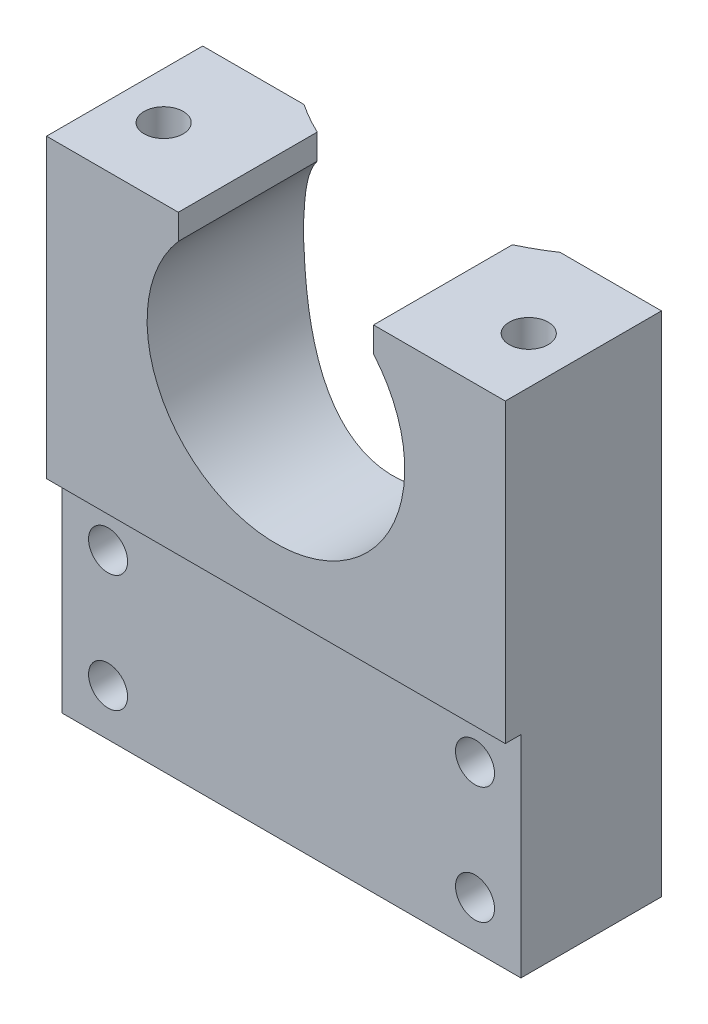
ISO-10303-21;
HEADER;
FILE_DESCRIPTION(('STEP AP214'),'2;1');
FILE_NAME('part.step','',(''),(''),'','','');
FILE_SCHEMA(('AUTOMOTIVE_DESIGN { 1 0 10303 214 1 1 1 1 }'));
ENDSEC;
DATA;
#1=APPLICATION_CONTEXT('core data for automotive mechanical design processes');
#2=APPLICATION_PROTOCOL_DEFINITION('international standard','automotive_design',2000,#1);
#3=PRODUCT_CONTEXT('',#1,'mechanical');
#4=PRODUCT('Part','Part','',(#3));
#5=PRODUCT_RELATED_PRODUCT_CATEGORY('part','',(#4));
#6=PRODUCT_DEFINITION_FORMATION('','',#4);
#7=PRODUCT_DEFINITION_CONTEXT('part definition',#1,'design');
#8=PRODUCT_DEFINITION('design','',#6,#7);
#9=PRODUCT_DEFINITION_SHAPE('','',#8);
#10=(LENGTH_UNIT() NAMED_UNIT(*) SI_UNIT(.MILLI.,.METRE.));
#11=(NAMED_UNIT(*) PLANE_ANGLE_UNIT() SI_UNIT($,.RADIAN.));
#12=(NAMED_UNIT(*) SI_UNIT($,.STERADIAN.) SOLID_ANGLE_UNIT());
#13=UNCERTAINTY_MEASURE_WITH_UNIT(LENGTH_MEASURE(1.E-05),#10,'distance_accuracy_value','');
#14=(GEOMETRIC_REPRESENTATION_CONTEXT(3) GLOBAL_UNCERTAINTY_ASSIGNED_CONTEXT((#13)) GLOBAL_UNIT_ASSIGNED_CONTEXT((#10,
#11,#12)) REPRESENTATION_CONTEXT('',''));
#15=CARTESIAN_POINT('',(0.,0.,0.));
#16=DIRECTION('',(0.,0.,1.));
#17=DIRECTION('',(1.,0.,0.));
#18=AXIS2_PLACEMENT_3D('',#15,#16,#17);
#19=CARTESIAN_POINT('',(0.,82.55,-56.3626));
#20=DIRECTION('',(0.,-1.,0.));
#21=DIRECTION('',(0.,0.,-1.));
#22=AXIS2_PLACEMENT_3D('',#19,#20,#21);
#23=CYLINDRICAL_SURFACE('',#22,37.3126);
#24=DIRECTION('',(0.,-1.,0.));
#25=VECTOR('',#24,1.);
#26=CARTESIAN_POINT('',(-20.8218039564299,82.55,-25.4));
#27=LINE('',#26,#25);
#28=CARTESIAN_POINT('',(-20.8218039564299,0.,-25.4));
#29=VERTEX_POINT('',#28);
#30=CARTESIAN_POINT('',(-20.8218039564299,62.4110796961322,-25.4));
#31=VERTEX_POINT('',#30);
#32=EDGE_CURVE('E267',#29,#31,#27,.F.);
#33=ORIENTED_EDGE('',*,*,#32,.T.);
#34=CARTESIAN_POINT('',(-20.8218039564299,62.4110796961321,-25.4));
#35=CARTESIAN_POINT('',(-20.7899938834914,62.1302744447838,-25.3786147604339));
#36=CARTESIAN_POINT('',(-20.7525346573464,61.8504444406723,-25.3534881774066));
#37=CARTESIAN_POINT('',(-20.6664908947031,61.293273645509,-25.2960741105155));
#38=CARTESIAN_POINT('',(-20.6179077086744,61.015932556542,-25.2637874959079));
#39=CARTESIAN_POINT('',(-20.4558594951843,60.1890707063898,-25.1567544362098));
#40=CARTESIAN_POINT('',(-20.3260116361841,59.6439737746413,-25.0717771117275));
#41=CARTESIAN_POINT('',(-20.0255086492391,58.5733533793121,-24.8786246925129));
#42=CARTESIAN_POINT('',(-19.8551156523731,58.0477282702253,-24.7705990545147));
#43=CARTESIAN_POINT('',(-19.4750880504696,57.015283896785,-24.5349229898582));
#44=CARTESIAN_POINT('',(-19.265443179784,56.5084695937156,-24.407267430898));
#45=CARTESIAN_POINT('',(-18.8099283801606,55.5182729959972,-24.1370432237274));
#46=CARTESIAN_POINT('',(-18.5642110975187,55.0348028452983,-23.9945381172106));
#47=CARTESIAN_POINT('',(-18.0378137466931,54.0909894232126,-23.6982680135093));
#48=CARTESIAN_POINT('',(-17.757136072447,53.6306445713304,-23.5445037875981));
#49=CARTESIAN_POINT('',(-17.1618961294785,52.7337369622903,-23.2293378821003));
#50=CARTESIAN_POINT('',(-16.8472664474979,52.2972242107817,-23.0679213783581));
#51=CARTESIAN_POINT('',(-16.1861152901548,51.4504554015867,-22.7415393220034));
#52=CARTESIAN_POINT('',(-15.8395918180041,51.0402009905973,-22.5765735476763));
#53=CARTESIAN_POINT('',(-15.0752974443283,50.2027784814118,-22.2281428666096));
#54=CARTESIAN_POINT('',(-14.6538977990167,49.7789099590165,-22.0446871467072));
#55=CARTESIAN_POINT('',(-13.7752658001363,48.9677343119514,-21.6826641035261));
#56=CARTESIAN_POINT('',(-13.3180310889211,48.580429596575,-21.5040971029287));
#57=CARTESIAN_POINT('',(-12.3698535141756,47.844910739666,-21.1564680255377));
#58=CARTESIAN_POINT('',(-11.8789170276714,47.496689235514,-20.9874041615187));
#59=CARTESIAN_POINT('',(-10.8656122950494,46.8419686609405,-20.6631388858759));
#60=CARTESIAN_POINT('',(-10.3432449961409,46.535468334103,-20.5079370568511));
#61=CARTESIAN_POINT('',(-9.26707612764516,45.9655870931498,-20.2147922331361));
#62=CARTESIAN_POINT('',(-8.71312369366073,45.7024414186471,-20.0769442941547));
#63=CARTESIAN_POINT('',(-7.57986868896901,45.2242642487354,-19.8234050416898));
#64=CARTESIAN_POINT('',(-7.00056556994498,45.009233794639,-19.7077142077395));
#65=CARTESIAN_POINT('',(-5.821554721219,44.630373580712,-19.5020880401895));
#66=CARTESIAN_POINT('',(-5.22186577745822,44.4664980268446,-19.4121296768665));
#67=CARTESIAN_POINT('',(-4.00687514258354,44.1922294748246,-19.2607184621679));
#68=CARTESIAN_POINT('',(-3.39157589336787,44.0818281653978,-19.1992611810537));
#69=CARTESIAN_POINT('',(-2.22671323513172,43.9263928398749,-19.112492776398));
#70=CARTESIAN_POINT('',(-1.67824201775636,43.8750483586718,-19.0836981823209));
#71=CARTESIAN_POINT('',(-0.578242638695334,43.8157416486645,-19.0504249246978));
#72=CARTESIAN_POINT('',(-0.0267147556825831,43.8077755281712,-19.045944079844));
#73=CARTESIAN_POINT('',(1.074770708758,43.8353310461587,-19.0614158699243));
#74=CARTESIAN_POINT('',(1.62472862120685,43.8708427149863,-19.0813629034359));
#75=CARTESIAN_POINT('',(2.71876017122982,43.9848412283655,-19.1451486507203));
#76=CARTESIAN_POINT('',(3.26283388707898,44.0633275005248,-19.1889870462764));
#77=CARTESIAN_POINT('',(4.3066221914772,44.2558933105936,-19.2958938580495));
#78=CARTESIAN_POINT('',(4.80695954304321,44.3673958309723,-19.357564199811));
#79=CARTESIAN_POINT('',(5.7956302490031,44.6259250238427,-19.4994723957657));
#80=CARTESIAN_POINT('',(6.28396429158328,44.772949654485,-19.5797091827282));
#81=CARTESIAN_POINT('',(7.2458750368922,45.1010504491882,-19.7570453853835));
#82=CARTESIAN_POINT('',(7.71945176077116,45.2821265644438,-19.8541447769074));
#83=CARTESIAN_POINT('',(8.64948729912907,45.6767130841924,-20.0632375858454));
#84=CARTESIAN_POINT('',(9.10594515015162,45.8902253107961,-20.1752318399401));
#85=CARTESIAN_POINT('',(10.0288456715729,46.3629278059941,-20.4196613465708));
#86=CARTESIAN_POINT('',(10.4940010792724,46.6241878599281,-20.5529530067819));
#87=CARTESIAN_POINT('',(11.4005552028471,47.1796049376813,-20.8311727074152));
#88=CARTESIAN_POINT('',(11.8419531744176,47.4737629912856,-20.9761011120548));
#89=CARTESIAN_POINT('',(12.6997211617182,48.0933901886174,-21.2748007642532));
#90=CARTESIAN_POINT('',(13.1160660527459,48.4188899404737,-21.4285805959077));
#91=CARTESIAN_POINT('',(13.921801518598,49.0992141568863,-21.7417907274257));
#92=CARTESIAN_POINT('',(14.3111904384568,49.4540404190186,-21.9012213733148));
#93=CARTESIAN_POINT('',(15.1079860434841,50.2369333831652,-22.2423844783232));
#94=CARTESIAN_POINT('',(15.5116898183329,50.6686353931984,-22.4244419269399));
#95=CARTESIAN_POINT('',(16.2815241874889,51.5649616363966,-22.7869667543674));
#96=CARTESIAN_POINT('',(16.6476538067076,52.0295867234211,-22.9674340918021));
#97=CARTESIAN_POINT('',(17.3398676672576,52.9890657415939,-23.3215644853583));
#98=CARTESIAN_POINT('',(17.6660120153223,53.4838725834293,-23.4952374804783));
#99=CARTESIAN_POINT('',(18.2767548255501,54.5023432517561,-23.8308953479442));
#100=CARTESIAN_POINT('',(18.5613523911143,55.0260077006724,-23.9928799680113));
#101=CARTESIAN_POINT('',(19.0815393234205,56.0895267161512,-24.2968235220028));
#102=CARTESIAN_POINT('',(19.3179605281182,56.6288813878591,-24.4391057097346));
#103=CARTESIAN_POINT('',(19.7459289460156,57.7301884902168,-24.7020317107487));
#104=CARTESIAN_POINT('',(19.9374911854,58.2921332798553,-24.8226827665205));
#105=CARTESIAN_POINT('',(20.1897805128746,59.1508656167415,-24.9840584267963));
#106=CARTESIAN_POINT('',(20.2682306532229,59.4407076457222,-25.0347150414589));
#107=CARTESIAN_POINT('',(20.4128365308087,60.024627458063,-25.1287454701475));
#108=CARTESIAN_POINT('',(20.4789927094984,60.3187050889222,-25.1721195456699));
#109=CARTESIAN_POINT('',(20.5987931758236,60.9108432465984,-25.2511063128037));
#110=CARTESIAN_POINT('',(20.6524207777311,61.2089085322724,-25.2867086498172));
#111=CARTESIAN_POINT('',(20.746819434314,61.8079779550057,-25.3496567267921));
#112=CARTESIAN_POINT('',(20.7875885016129,62.1089825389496,-25.3770011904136));
#113=CARTESIAN_POINT('',(20.8218039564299,62.4110796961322,-25.4));
#114=B_SPLINE_CURVE_WITH_KNOTS('',3,(#34,#35,#36,#37,#38,#39,#40,#41,#42,#43,#44,#45,#46,#47,
#48,#49,#50,#51,#52,#53,#54,#55,#56,#57,#58,#59,#60,#61,#62,#63,#64,#65,#66,#67,#68,#69,#70,#71,
#72,#73,#74,#75,#76,#77,#78,#79,#80,#81,#82,#83,#84,#85,#86,#87,#88,#89,#90,#91,#92,#93,#94,#95,
#96,#97,#98,#99,#100,#101,#102,#103,#104,#105,#106,#107,#108,#109,#110,#111,#112,#113),
.UNSPECIFIED.,.F.,.F.,(4,2,2,2,2,2,2,2,2,2,2,2,2,2,2,2,2,2,2,2,2,2,2,2,2,2,2,2,2,2,2,2,2,2,2,2,
2,2,2,4),(0.,0.850051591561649,1.70000003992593,3.3976720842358,5.08465312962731,
6.77207599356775,8.45255376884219,10.1329165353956,11.8166793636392,13.5005476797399,
15.3740762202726,17.2477281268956,19.121026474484,20.9942683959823,22.8773616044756,
24.7604955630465,26.6419388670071,28.5230896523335,30.175772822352,31.8283077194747,
33.4804637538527,35.1325977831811,36.6798079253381,38.2269291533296,39.7740481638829,
41.3212541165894,42.9692707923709,44.6173390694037,46.2670334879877,47.9168291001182,
49.7701431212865,51.6235052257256,53.4740462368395,55.3246271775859,57.1398811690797,
58.9545262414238,59.8677676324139,60.7809762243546,61.6953941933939,62.6099534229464),.UNSPECIFIED.);
#115=CARTESIAN_POINT('',(20.8218039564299,62.4110796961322,-25.4));
#116=VERTEX_POINT('',#115);
#117=EDGE_CURVE('E57',#31,#116,#114,.T.);
#118=ORIENTED_EDGE('',*,*,#117,.T.);
#119=DIRECTION('',(0.,-1.,0.));
#120=VECTOR('',#119,1.);
#121=CARTESIAN_POINT('',(20.8218039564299,82.55,-25.4));
#122=LINE('',#121,#120);
#123=CARTESIAN_POINT('',(20.8218039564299,0.,-25.4));
#124=VERTEX_POINT('',#123);
#125=EDGE_CURVE('E266',#116,#124,#122,.T.);
#126=ORIENTED_EDGE('',*,*,#125,.T.);
#127=CARTESIAN_POINT('',(0.,0.,-56.3626));
#128=DIRECTION('',(0.,-1.,0.));
#129=DIRECTION('',(0.,0.,1.));
#130=AXIS2_PLACEMENT_3D('',#127,#128,#129);
#131=CIRCLE('',#130,37.3126);
#132=EDGE_CURVE('E280',#124,#29,#131,.T.);
#133=ORIENTED_EDGE('',*,*,#132,.T.);
#134=EDGE_LOOP('',(#33,#118,#126,#133));
#135=FACE_BOUND('',#134,.T.);
#136=ADVANCED_FACE('F34',(#135),#23,.F.);
#137=CARTESIAN_POINT('',(20.8218039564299,67.1289203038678,-25.4));
#138=CARTESIAN_POINT('',(20.7896968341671,67.412347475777,-25.3784152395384));
#139=CARTESIAN_POINT('',(20.7518347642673,67.6947799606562,-25.3530188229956));
#140=CARTESIAN_POINT('',(20.664778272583,68.2571046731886,-25.2949338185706));
#141=CARTESIAN_POINT('',(20.6155851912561,68.5369971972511,-25.2622460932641));
#142=CARTESIAN_POINT('',(20.4514017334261,69.3714299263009,-25.1538256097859));
#143=CARTESIAN_POINT('',(20.3197244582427,69.9214497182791,-25.0676788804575));
#144=CARTESIAN_POINT('',(20.0176544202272,70.9915071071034,-24.8736349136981));
#145=CARTESIAN_POINT('',(19.8483000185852,71.5119498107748,-24.7663284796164));
#146=CARTESIAN_POINT('',(19.4711137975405,72.5343177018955,-24.5325034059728));
#147=CARTESIAN_POINT('',(19.2632759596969,73.0362399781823,-24.4059817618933));
#148=CARTESIAN_POINT('',(18.8332224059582,73.97109190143,-24.150861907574));
#149=CARTESIAN_POINT('',(18.614390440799,74.405973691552,-24.0236719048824));
#150=CARTESIAN_POINT('',(18.1484056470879,75.2572696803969,-23.7598827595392));
#151=CARTESIAN_POINT('',(17.9012543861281,75.6736848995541,-23.623284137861));
#152=CARTESIAN_POINT('',(17.3738287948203,76.4963114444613,-23.3403083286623));
#153=CARTESIAN_POINT('',(17.0929192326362,76.902062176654,-23.193777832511));
#154=CARTESIAN_POINT('',(16.5039953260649,77.6917884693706,-22.8968380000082));
#155=CARTESIAN_POINT('',(16.1959855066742,78.0757676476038,-22.7464293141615));
#156=CARTESIAN_POINT('',(15.875,78.4483186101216,-22.5955377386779));
#157=B_SPLINE_CURVE_WITH_KNOTS('',3,(#137,#138,#139,#140,#141,#142,#143,#144,#145,#146,#147,
#148,#149,#150,#151,#152,#153,#154,#155,#156),.UNSPECIFIED.,.F.,.F.,(4,2,2,2,2,2,2,2,2,4),(0.,
0.85798401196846,1.71586657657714,3.42944667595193,5.10063490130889,6.77208470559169,
8.28038104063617,9.78859392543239,11.3317836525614,12.8747161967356),.UNSPECIFIED.);
#158=CARTESIAN_POINT('',(20.8218039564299,67.1289203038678,-25.4));
#159=VERTEX_POINT('',#158);
#160=CARTESIAN_POINT('',(15.875,78.4483186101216,-22.5955377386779));
#161=VERTEX_POINT('',#160);
#162=EDGE_CURVE('E229',#159,#161,#157,.T.);
#163=ORIENTED_EDGE('',*,*,#162,.T.);
#164=DIRECTION('',(0.,-1.,0.));
#165=VECTOR('',#164,1.);
#166=CARTESIAN_POINT('',(15.875,82.55,-22.5955377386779));
#167=LINE('',#166,#165);
#168=CARTESIAN_POINT('',(15.875,82.55,-22.5955377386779));
#169=VERTEX_POINT('',#168);
#170=EDGE_CURVE('E256',#161,#169,#167,.F.);
#171=ORIENTED_EDGE('',*,*,#170,.T.);
#172=CARTESIAN_POINT('',(0.,82.55,-56.3626));
#173=DIRECTION('',(0.,-1.,0.));
#174=DIRECTION('',(0.,0.,1.));
#175=AXIS2_PLACEMENT_3D('',#172,#173,#174);
#176=CIRCLE('',#175,37.3126);
#177=CARTESIAN_POINT('',(20.8218039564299,82.55,-25.4));
#178=VERTEX_POINT('',#177);
#179=EDGE_CURVE('E288',#178,#169,#176,.T.);
#180=ORIENTED_EDGE('',*,*,#179,.F.);
#181=EDGE_CURVE('E262',#178,#159,#122,.T.);
#182=ORIENTED_EDGE('',*,*,#181,.T.);
#183=EDGE_LOOP('',(#163,#171,#180,#182));
#184=FACE_BOUND('',#183,.T.);
#185=ADVANCED_FACE('F369',(#184),#23,.F.);
#186=CARTESIAN_POINT('',(0.,82.55,-56.3626));
#187=DIRECTION('',(0.,1.,0.));
#188=DIRECTION('',(0.,0.,1.));
#189=AXIS2_PLACEMENT_3D('',#186,#187,#188);
#190=PLANE('',#189);
#191=CARTESIAN_POINT('',(29.6926,82.55,-11.43));
#192=DIRECTION('',(0.,1.,0.));
#193=DIRECTION('',(0.,0.,1.));
#194=AXIS2_PLACEMENT_3D('',#191,#192,#193);
#195=CIRCLE('',#194,3.17499999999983);
#196=CARTESIAN_POINT('',(29.6926,82.55,-8.25500000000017));
#197=VERTEX_POINT('',#196);
#198=EDGE_CURVE('E149',#197,#197,#195,.T.);
#199=ORIENTED_EDGE('',*,*,#198,.F.);
#200=EDGE_LOOP('',(#199));
#201=FACE_BOUND('',#200,.T.);
#202=DIRECTION('',(0.,0.,-1.));
#203=VECTOR('',#202,1.);
#204=CARTESIAN_POINT('',(15.875,82.55,-56.3626));
#205=LINE('',#204,#203);
#206=CARTESIAN_POINT('',(15.875,82.55,0.));
#207=VERTEX_POINT('',#206);
#208=EDGE_CURVE('E11',#207,#169,#205,.T.);
#209=ORIENTED_EDGE('',*,*,#208,.F.);
#210=DIRECTION('',(1.,0.,0.));
#211=VECTOR('',#210,1.);
#212=CARTESIAN_POINT('',(37.3126,82.55,0.));
#213=LINE('',#212,#211);
#214=CARTESIAN_POINT('',(37.3126,82.55,0.));
#215=VERTEX_POINT('',#214);
#216=EDGE_CURVE('E279',#207,#215,#213,.T.);
#217=ORIENTED_EDGE('',*,*,#216,.T.);
#218=DIRECTION('',(0.,0.,-1.));
#219=VECTOR('',#218,1.);
#220=CARTESIAN_POINT('',(37.3126,82.55,0.));
#221=LINE('',#220,#219);
#222=CARTESIAN_POINT('',(37.3126,82.55,-25.4));
#223=VERTEX_POINT('',#222);
#224=EDGE_CURVE('E284',#215,#223,#221,.T.);
#225=ORIENTED_EDGE('',*,*,#224,.T.);
#226=DIRECTION('',(1.,0.,0.));
#227=VECTOR('',#226,1.);
#228=CARTESIAN_POINT('',(-44.45,82.55,-25.4));
#229=LINE('',#228,#227);
#230=EDGE_CURVE('E259',#178,#223,#229,.T.);
#231=ORIENTED_EDGE('',*,*,#230,.F.);
#232=ORIENTED_EDGE('',*,*,#179,.T.);
#233=EDGE_LOOP('',(#209,#217,#225,#231,#232));
#234=FACE_BOUND('',#233,.T.);
#235=ADVANCED_FACE('F339',(#201,#234),#190,.T.);
#236=CARTESIAN_POINT('',(-37.3126,82.55,0.));
#237=DIRECTION('',(1.,0.,0.));
#238=DIRECTION('',(0.,0.,-1.));
#239=AXIS2_PLACEMENT_3D('',#236,#237,#238);
#240=PLANE('',#239);
#241=DIRECTION('',(0.,-1.,0.));
#242=VECTOR('',#241,1.);
#243=CARTESIAN_POINT('',(-37.3126,0.,-2.54));
#244=LINE('',#243,#242);
#245=CARTESIAN_POINT('',(-37.3126,34.29,-2.54));
#246=VERTEX_POINT('',#245);
#247=CARTESIAN_POINT('',(-37.3126,0.,-2.54));
#248=VERTEX_POINT('',#247);
#249=EDGE_CURVE('E49',#246,#248,#244,.T.);
#250=ORIENTED_EDGE('',*,*,#249,.F.);
#251=DIRECTION('',(0.,0.,1.));
#252=VECTOR('',#251,1.);
#253=CARTESIAN_POINT('',(-37.3126,34.29,-2.54));
#254=LINE('',#253,#252);
#255=CARTESIAN_POINT('',(-37.3126,34.29,0.));
#256=VERTEX_POINT('',#255);
#257=EDGE_CURVE('E202',#246,#256,#254,.T.);
#258=ORIENTED_EDGE('',*,*,#257,.T.);
#259=DIRECTION('',(0.,-1.,0.));
#260=VECTOR('',#259,1.);
#261=CARTESIAN_POINT('',(-37.3126,82.55,0.));
#262=LINE('',#261,#260);
#263=CARTESIAN_POINT('',(-37.3126,82.55,0.));
#264=VERTEX_POINT('',#263);
#265=EDGE_CURVE('E300',#264,#256,#262,.T.);
#266=ORIENTED_EDGE('',*,*,#265,.F.);
#267=DIRECTION('',(0.,0.,1.));
#268=VECTOR('',#267,1.);
#269=CARTESIAN_POINT('',(-37.3126,82.55,0.));
#270=LINE('',#269,#268);
#271=CARTESIAN_POINT('',(-37.3126,82.55,-25.4));
#272=VERTEX_POINT('',#271);
#273=EDGE_CURVE('E277',#272,#264,#270,.T.);
#274=ORIENTED_EDGE('',*,*,#273,.F.);
#275=DIRECTION('',(0.,-1.,0.));
#276=VECTOR('',#275,1.);
#277=CARTESIAN_POINT('',(-37.3126,82.55,-25.4));
#278=LINE('',#277,#276);
#279=CARTESIAN_POINT('',(-37.3126,0.,-25.4));
#280=VERTEX_POINT('',#279);
#281=EDGE_CURVE('E273',#272,#280,#278,.T.);
#282=ORIENTED_EDGE('',*,*,#281,.T.);
#283=DIRECTION('',(0.,0.,1.));
#284=VECTOR('',#283,1.);
#285=CARTESIAN_POINT('',(-37.3126,0.,0.));
#286=LINE('',#285,#284);
#287=EDGE_CURVE('E276',#280,#248,#286,.T.);
#288=ORIENTED_EDGE('',*,*,#287,.T.);
#289=EDGE_LOOP('',(#250,#258,#266,#274,#282,#288));
#290=FACE_BOUND('',#289,.T.);
#291=ADVANCED_FACE('F36',(#290),#240,.F.);
#292=CARTESIAN_POINT('',(37.3126,82.55,0.));
#293=DIRECTION('',(0.,0.,-1.));
#294=DIRECTION('',(-1.,0.,0.));
#295=AXIS2_PLACEMENT_3D('',#292,#293,#294);
#296=PLANE('',#295);
#297=ORIENTED_EDGE('',*,*,#265,.T.);
#298=DIRECTION('',(-1.,0.,0.));
#299=VECTOR('',#298,1.);
#300=CARTESIAN_POINT('',(-37.3126,34.29,0.));
#301=LINE('',#300,#299);
#302=CARTESIAN_POINT('',(37.3126,34.29,0.));
#303=VERTEX_POINT('',#302);
#304=EDGE_CURVE('E192',#303,#256,#301,.T.);
#305=ORIENTED_EDGE('',*,*,#304,.F.);
#306=DIRECTION('',(0.,-1.,0.));
#307=VECTOR('',#306,1.);
#308=CARTESIAN_POINT('',(37.3126,82.55,0.));
#309=LINE('',#308,#307);
#310=EDGE_CURVE('E291',#215,#303,#309,.T.);
#311=ORIENTED_EDGE('',*,*,#310,.F.);
#312=ORIENTED_EDGE('',*,*,#216,.F.);
#313=DIRECTION('',(0.,1.,0.));
#314=VECTOR('',#313,1.);
#315=CARTESIAN_POINT('',(15.875,82.55,0.));
#316=LINE('',#315,#314);
#317=CARTESIAN_POINT('',(15.875,78.4483186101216,0.));
#318=VERTEX_POINT('',#317);
#319=EDGE_CURVE('E205',#318,#207,#316,.T.);
#320=ORIENTED_EDGE('',*,*,#319,.F.);
#321=CARTESIAN_POINT('',(0.,64.77,0.));
#322=DIRECTION('',(0.,0.,1.));
#323=DIRECTION('',(1.,0.,0.));
#324=AXIS2_PLACEMENT_3D('',#321,#322,#323);
#325=CIRCLE('',#324,20.955);
#326=CARTESIAN_POINT('',(-15.875,78.4483186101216,0.));
#327=VERTEX_POINT('',#326);
#328=EDGE_CURVE('E211',#327,#318,#325,.T.);
#329=ORIENTED_EDGE('',*,*,#328,.F.);
#330=DIRECTION('',(0.,-1.,0.));
#331=VECTOR('',#330,1.);
#332=CARTESIAN_POINT('',(-15.875,78.4483186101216,0.));
#333=LINE('',#332,#331);
#334=CARTESIAN_POINT('',(-15.875,82.55,0.));
#335=VERTEX_POINT('',#334);
#336=EDGE_CURVE('E213',#335,#327,#333,.T.);
#337=ORIENTED_EDGE('',*,*,#336,.F.);
#338=EDGE_CURVE('E281',#264,#335,#213,.T.);
#339=ORIENTED_EDGE('',*,*,#338,.F.);
#340=EDGE_LOOP('',(#297,#305,#311,#312,#320,#329,#337,#339));
#341=FACE_BOUND('',#340,.T.);
#342=ADVANCED_FACE('F317',(#341),#296,.F.);
#343=CARTESIAN_POINT('',(37.3126,82.55,0.));
#344=DIRECTION('',(-1.,0.,0.));
#345=DIRECTION('',(0.,0.,1.));
#346=AXIS2_PLACEMENT_3D('',#343,#344,#345);
#347=PLANE('',#346);
#348=ORIENTED_EDGE('',*,*,#310,.T.);
#349=DIRECTION('',(0.,0.,1.));
#350=VECTOR('',#349,1.);
#351=CARTESIAN_POINT('',(37.3126,34.29,-2.54));
#352=LINE('',#351,#350);
#353=CARTESIAN_POINT('',(37.3126,34.29,-2.54));
#354=VERTEX_POINT('',#353);
#355=EDGE_CURVE('E200',#354,#303,#352,.T.);
#356=ORIENTED_EDGE('',*,*,#355,.F.);
#357=DIRECTION('',(0.,1.,0.));
#358=VECTOR('',#357,1.);
#359=CARTESIAN_POINT('',(37.3126,0.,-2.54));
#360=LINE('',#359,#358);
#361=CARTESIAN_POINT('',(37.3126,0.,-2.54));
#362=VERTEX_POINT('',#361);
#363=EDGE_CURVE('E196',#362,#354,#360,.T.);
#364=ORIENTED_EDGE('',*,*,#363,.F.);
#365=DIRECTION('',(0.,0.,-1.));
#366=VECTOR('',#365,1.);
#367=CARTESIAN_POINT('',(37.3126,0.,0.));
#368=LINE('',#367,#366);
#369=CARTESIAN_POINT('',(37.3126,0.,-25.4));
#370=VERTEX_POINT('',#369);
#371=EDGE_CURVE('E294',#362,#370,#368,.T.);
#372=ORIENTED_EDGE('',*,*,#371,.T.);
#373=DIRECTION('',(0.,1.,0.));
#374=VECTOR('',#373,1.);
#375=CARTESIAN_POINT('',(37.3126,82.55,-25.4));
#376=LINE('',#375,#374);
#377=EDGE_CURVE('E270',#370,#223,#376,.T.);
#378=ORIENTED_EDGE('',*,*,#377,.T.);
#379=ORIENTED_EDGE('',*,*,#224,.F.);
#380=EDGE_LOOP('',(#348,#356,#364,#372,#378,#379));
#381=FACE_BOUND('',#380,.T.);
#382=ADVANCED_FACE('F333',(#381),#347,.F.);
#383=DIRECTION('',(0.,-1.,0.));
#384=VECTOR('',#383,1.);
#385=CARTESIAN_POINT('',(-15.875,82.55,-22.5955377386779));
#386=LINE('',#385,#384);
#387=CARTESIAN_POINT('',(-15.875,82.55,-22.5955377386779));
#388=VERTEX_POINT('',#387);
#389=CARTESIAN_POINT('',(-15.875,78.4483186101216,-22.5955377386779));
#390=VERTEX_POINT('',#389);
#391=EDGE_CURVE('E253',#388,#390,#386,.T.);
#392=ORIENTED_EDGE('',*,*,#391,.T.);
#393=CARTESIAN_POINT('',(-15.875,78.4483186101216,-22.5955377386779));
#394=CARTESIAN_POINT('',(-16.2478505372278,78.0155646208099,-22.7708018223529));
#395=CARTESIAN_POINT('',(-16.6032138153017,77.5673721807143,-22.9454366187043));
#396=CARTESIAN_POINT('',(-17.2772899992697,76.641627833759,-23.2889223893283));
#397=CARTESIAN_POINT('',(-17.5959769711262,76.164055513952,-23.4577692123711));
#398=CARTESIAN_POINT('',(-18.1865247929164,75.1947644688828,-23.7805380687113));
#399=CARTESIAN_POINT('',(-18.459406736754,74.703761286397,-23.9347378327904));
#400=CARTESIAN_POINT('',(-18.9662739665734,73.6980128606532,-24.2285624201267));
#401=CARTESIAN_POINT('',(-19.2002719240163,73.1832754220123,-24.3681919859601));
#402=CARTESIAN_POINT('',(-19.5891148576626,72.2262494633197,-24.60509877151));
#403=CARTESIAN_POINT('',(-19.7506327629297,71.7874339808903,-24.7054866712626));
#404=CARTESIAN_POINT('',(-20.0447086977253,70.8971047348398,-24.8908667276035));
#405=CARTESIAN_POINT('',(-20.1772729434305,70.4455937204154,-24.975862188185));
#406=CARTESIAN_POINT('',(-20.4148533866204,69.5216534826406,-25.129853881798));
#407=CARTESIAN_POINT('',(-20.5191947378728,69.0489824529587,-25.1984542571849));
#408=CARTESIAN_POINT('',(-20.6512124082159,68.3334812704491,-25.2859158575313));
#409=CARTESIAN_POINT('',(-20.6911489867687,68.0937835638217,-25.3125054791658));
#410=CARTESIAN_POINT('',(-20.7627261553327,67.6126040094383,-25.3603238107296));
#411=CARTESIAN_POINT('',(-20.7943661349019,67.3711220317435,-25.3815521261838));
#412=CARTESIAN_POINT('',(-20.8218039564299,67.1289203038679,-25.4));
#413=B_SPLINE_CURVE_WITH_KNOTS('',3,(#393,#394,#395,#396,#397,#398,#399,#400,#401,#402,#403,
#404,#405,#406,#407,#408,#409,#410,#411,#412),.UNSPECIFIED.,.F.,.F.,(4,2,2,2,2,2,2,2,2,4),(0.,
1.7921964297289,3.58565244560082,5.33134191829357,7.07646138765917,8.51000686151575,
9.94324425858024,11.4082114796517,12.141388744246,12.8746199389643),.UNSPECIFIED.);
#414=CARTESIAN_POINT('',(-20.8218039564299,67.1289203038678,-25.4));
#415=VERTEX_POINT('',#414);
#416=EDGE_CURVE('E220',#390,#415,#413,.T.);
#417=ORIENTED_EDGE('',*,*,#416,.T.);
#418=CARTESIAN_POINT('',(-20.8218039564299,82.55,-25.4));
#419=VERTEX_POINT('',#418);
#420=EDGE_CURVE('E265',#415,#419,#27,.F.);
#421=ORIENTED_EDGE('',*,*,#420,.T.);
#422=EDGE_CURVE('E287',#388,#419,#176,.T.);
#423=ORIENTED_EDGE('',*,*,#422,.F.);
#424=EDGE_LOOP('',(#392,#417,#421,#423));
#425=FACE_BOUND('',#424,.T.);
#426=ADVANCED_FACE('F234',(#425),#23,.F.);
#427=CARTESIAN_POINT('',(-29.6926,82.55,-11.43));
#428=DIRECTION('',(0.,1.,0.));
#429=DIRECTION('',(0.,0.,1.));
#430=AXIS2_PLACEMENT_3D('',#427,#428,#429);
#431=CIRCLE('',#430,3.17499999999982);
#432=CARTESIAN_POINT('',(-29.6926,82.55,-8.25500000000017));
#433=VERTEX_POINT('',#432);
#434=EDGE_CURVE('E457',#433,#433,#431,.T.);
#435=ORIENTED_EDGE('',*,*,#434,.F.);
#436=EDGE_LOOP('',(#435));
#437=FACE_BOUND('',#436,.T.);
#438=DIRECTION('',(0.,0.,1.));
#439=VECTOR('',#438,1.);
#440=CARTESIAN_POINT('',(-15.875,82.55,-56.3626));
#441=LINE('',#440,#439);
#442=EDGE_CURVE('E42',#388,#335,#441,.T.);
#443=ORIENTED_EDGE('',*,*,#442,.F.);
#444=ORIENTED_EDGE('',*,*,#422,.T.);
#445=EDGE_CURVE('E261',#272,#419,#229,.T.);
#446=ORIENTED_EDGE('',*,*,#445,.F.);
#447=ORIENTED_EDGE('',*,*,#273,.T.);
#448=ORIENTED_EDGE('',*,*,#338,.T.);
#449=EDGE_LOOP('',(#443,#444,#446,#447,#448));
#450=FACE_BOUND('',#449,.T.);
#451=ADVANCED_FACE('F320',(#437,#450),#190,.T.);
#452=CARTESIAN_POINT('',(0.,0.,-56.3626));
#453=DIRECTION('',(0.,1.,0.));
#454=DIRECTION('',(0.,0.,1.));
#455=AXIS2_PLACEMENT_3D('',#452,#453,#454);
#456=PLANE('',#455);
#457=ORIENTED_EDGE('',*,*,#371,.F.);
#458=DIRECTION('',(1.,0.,0.));
#459=VECTOR('',#458,1.);
#460=CARTESIAN_POINT('',(-37.3126,0.,-2.54));
#461=LINE('',#460,#459);
#462=EDGE_CURVE('E194',#248,#362,#461,.T.);
#463=ORIENTED_EDGE('',*,*,#462,.F.);
#464=ORIENTED_EDGE('',*,*,#287,.F.);
#465=DIRECTION('',(1.,0.,0.));
#466=VECTOR('',#465,1.);
#467=CARTESIAN_POINT('',(0.,0.,-25.4));
#468=LINE('',#467,#466);
#469=EDGE_CURVE('E306',#280,#29,#468,.T.);
#470=ORIENTED_EDGE('',*,*,#469,.T.);
#471=ORIENTED_EDGE('',*,*,#132,.F.);
#472=EDGE_CURVE('E303',#124,#370,#468,.T.);
#473=ORIENTED_EDGE('',*,*,#472,.T.);
#474=EDGE_LOOP('',(#457,#463,#464,#470,#471,#473));
#475=FACE_BOUND('',#474,.T.);
#476=ADVANCED_FACE('F359',(#475),#456,.F.);
#477=CARTESIAN_POINT('',(-44.45,0.,-25.4));
#478=DIRECTION('',(0.,0.,1.));
#479=DIRECTION('',(1.,0.,0.));
#480=AXIS2_PLACEMENT_3D('',#477,#478,#479);
#481=PLANE('',#480);
#482=CARTESIAN_POINT('',(29.845,7.62,-25.4));
#483=DIRECTION('',(0.,0.,1.));
#484=DIRECTION('',(1.,0.,0.));
#485=AXIS2_PLACEMENT_3D('',#482,#483,#484);
#486=CIRCLE('',#485,3.17499999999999);
#487=CARTESIAN_POINT('',(33.02,7.62,-25.4));
#488=VERTEX_POINT('',#487);
#489=EDGE_CURVE('E183',#488,#488,#486,.T.);
#490=ORIENTED_EDGE('',*,*,#489,.T.);
#491=EDGE_LOOP('',(#490));
#492=FACE_BOUND('',#491,.T.);
#493=CARTESIAN_POINT('',(29.845,26.67,-25.4));
#494=DIRECTION('',(0.,0.,1.));
#495=DIRECTION('',(1.,0.,0.));
#496=AXIS2_PLACEMENT_3D('',#493,#494,#495);
#497=CIRCLE('',#496,3.17499999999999);
#498=CARTESIAN_POINT('',(33.02,26.67,-25.4));
#499=VERTEX_POINT('',#498);
#500=EDGE_CURVE('E189',#499,#499,#497,.T.);
#501=ORIENTED_EDGE('',*,*,#500,.T.);
#502=EDGE_LOOP('',(#501));
#503=FACE_BOUND('',#502,.T.);
#504=ORIENTED_EDGE('',*,*,#125,.F.);
#505=CARTESIAN_POINT('',(0.,64.77,-25.4));
#506=DIRECTION('',(0.,0.,1.));
#507=DIRECTION('',(1.,0.,0.));
#508=AXIS2_PLACEMENT_3D('',#505,#506,#507);
#509=CIRCLE('',#508,20.955);
#510=EDGE_CURVE('E207',#116,#159,#509,.T.);
#511=ORIENTED_EDGE('',*,*,#510,.T.);
#512=ORIENTED_EDGE('',*,*,#181,.F.);
#513=ORIENTED_EDGE('',*,*,#230,.T.);
#514=ORIENTED_EDGE('',*,*,#377,.F.);
#515=ORIENTED_EDGE('',*,*,#472,.F.);
#516=EDGE_LOOP('',(#504,#511,#512,#513,#514,#515));
#517=FACE_BOUND('',#516,.T.);
#518=ADVANCED_FACE('F355',(#492,#503,#517),#481,.F.);
#519=CARTESIAN_POINT('',(-29.845,26.67,-25.4));
#520=DIRECTION('',(0.,0.,1.));
#521=DIRECTION('',(1.,0.,0.));
#522=AXIS2_PLACEMENT_3D('',#519,#520,#521);
#523=CIRCLE('',#522,3.17499999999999);
#524=CARTESIAN_POINT('',(-26.67,26.67,-25.4));
#525=VERTEX_POINT('',#524);
#526=EDGE_CURVE('E171',#525,#525,#523,.T.);
#527=ORIENTED_EDGE('',*,*,#526,.T.);
#528=EDGE_LOOP('',(#527));
#529=FACE_BOUND('',#528,.T.);
#530=CARTESIAN_POINT('',(-29.845,7.62,-25.4));
#531=DIRECTION('',(0.,0.,1.));
#532=DIRECTION('',(1.,0.,0.));
#533=AXIS2_PLACEMENT_3D('',#530,#531,#532);
#534=CIRCLE('',#533,3.17499999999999);
#535=CARTESIAN_POINT('',(-26.67,7.62,-25.4));
#536=VERTEX_POINT('',#535);
#537=EDGE_CURVE('E177',#536,#536,#534,.T.);
#538=ORIENTED_EDGE('',*,*,#537,.T.);
#539=EDGE_LOOP('',(#538));
#540=FACE_BOUND('',#539,.T.);
#541=ORIENTED_EDGE('',*,*,#420,.F.);
#542=CARTESIAN_POINT('',(0.,64.77,-25.4));
#543=DIRECTION('',(0.,0.,1.));
#544=DIRECTION('',(1.,0.,0.));
#545=AXIS2_PLACEMENT_3D('',#542,#543,#544);
#546=CIRCLE('',#545,20.955);
#547=EDGE_CURVE('E307',#415,#31,#546,.T.);
#548=ORIENTED_EDGE('',*,*,#547,.T.);
#549=ORIENTED_EDGE('',*,*,#32,.F.);
#550=ORIENTED_EDGE('',*,*,#469,.F.);
#551=ORIENTED_EDGE('',*,*,#281,.F.);
#552=ORIENTED_EDGE('',*,*,#445,.T.);
#553=EDGE_LOOP('',(#541,#548,#549,#550,#551,#552));
#554=FACE_BOUND('',#553,.T.);
#555=ADVANCED_FACE('F349',(#529,#540,#554),#481,.F.);
#556=CARTESIAN_POINT('',(15.875,82.55,-25.4));
#557=DIRECTION('',(1.,0.,0.));
#558=DIRECTION('',(0.,0.,-1.));
#559=AXIS2_PLACEMENT_3D('',#556,#557,#558);
#560=PLANE('',#559);
#561=DIRECTION('',(0.,0.,1.));
#562=VECTOR('',#561,1.);
#563=CARTESIAN_POINT('',(15.875,78.4483186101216,-25.4));
#564=LINE('',#563,#562);
#565=EDGE_CURVE('E218',#161,#318,#564,.T.);
#566=ORIENTED_EDGE('',*,*,#565,.T.);
#567=ORIENTED_EDGE('',*,*,#319,.T.);
#568=ORIENTED_EDGE('',*,*,#208,.T.);
#569=ORIENTED_EDGE('',*,*,#170,.F.);
#570=EDGE_LOOP('',(#566,#567,#568,#569));
#571=FACE_BOUND('',#570,.T.);
#572=ADVANCED_FACE('F342',(#571),#560,.F.);
#573=CARTESIAN_POINT('',(-15.875,78.4483186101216,-25.4));
#574=DIRECTION('',(-1.,0.,0.));
#575=DIRECTION('',(0.,0.,1.));
#576=AXIS2_PLACEMENT_3D('',#573,#574,#575);
#577=PLANE('',#576);
#578=ORIENTED_EDGE('',*,*,#442,.T.);
#579=ORIENTED_EDGE('',*,*,#336,.T.);
#580=DIRECTION('',(0.,0.,1.));
#581=VECTOR('',#580,1.);
#582=CARTESIAN_POINT('',(-15.875,78.4483186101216,-25.4));
#583=LINE('',#582,#581);
#584=EDGE_CURVE('E210',#390,#327,#583,.T.);
#585=ORIENTED_EDGE('',*,*,#584,.F.);
#586=ORIENTED_EDGE('',*,*,#391,.F.);
#587=EDGE_LOOP('',(#578,#579,#585,#586));
#588=FACE_BOUND('',#587,.T.);
#589=ADVANCED_FACE('F244',(#588),#577,.F.);
#590=CARTESIAN_POINT('',(0.,64.77,-25.4));
#591=DIRECTION('',(0.,0.,1.));
#592=DIRECTION('',(1.,0.,0.));
#593=AXIS2_PLACEMENT_3D('',#590,#591,#592);
#594=CYLINDRICAL_SURFACE('',#593,20.955);
#595=ORIENTED_EDGE('',*,*,#547,.F.);
#596=ORIENTED_EDGE('',*,*,#416,.F.);
#597=ORIENTED_EDGE('',*,*,#584,.T.);
#598=ORIENTED_EDGE('',*,*,#328,.T.);
#599=ORIENTED_EDGE('',*,*,#565,.F.);
#600=ORIENTED_EDGE('',*,*,#162,.F.);
#601=ORIENTED_EDGE('',*,*,#510,.F.);
#602=ORIENTED_EDGE('',*,*,#117,.F.);
#603=EDGE_LOOP('',(#595,#596,#597,#598,#599,#600,#601,#602));
#604=FACE_BOUND('',#603,.T.);
#605=ADVANCED_FACE('F238',(#604),#594,.F.);
#606=CARTESIAN_POINT('',(-37.3126,34.29,-2.54));
#607=DIRECTION('',(0.,1.,0.));
#608=DIRECTION('',(0.,0.,1.));
#609=AXIS2_PLACEMENT_3D('',#606,#607,#608);
#610=PLANE('',#609);
#611=ORIENTED_EDGE('',*,*,#304,.T.);
#612=ORIENTED_EDGE('',*,*,#257,.F.);
#613=DIRECTION('',(-1.,0.,0.));
#614=VECTOR('',#613,1.);
#615=CARTESIAN_POINT('',(-37.3126,34.29,-2.54));
#616=LINE('',#615,#614);
#617=EDGE_CURVE('E198',#354,#246,#616,.T.);
#618=ORIENTED_EDGE('',*,*,#617,.F.);
#619=ORIENTED_EDGE('',*,*,#355,.T.);
#620=EDGE_LOOP('',(#611,#612,#618,#619));
#621=FACE_BOUND('',#620,.T.);
#622=ADVANCED_FACE('F243',(#621),#610,.F.);
#623=CARTESIAN_POINT('',(-37.3126,34.29,-2.54));
#624=DIRECTION('',(0.,0.,-1.));
#625=DIRECTION('',(-1.,0.,0.));
#626=AXIS2_PLACEMENT_3D('',#623,#624,#625);
#627=PLANE('',#626);
#628=CARTESIAN_POINT('',(-29.845,26.67,-2.54));
#629=DIRECTION('',(0.,0.,1.));
#630=DIRECTION('',(1.,0.,0.));
#631=AXIS2_PLACEMENT_3D('',#628,#629,#630);
#632=CIRCLE('',#631,3.17499999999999);
#633=CARTESIAN_POINT('',(-26.67,26.67,-2.54));
#634=VERTEX_POINT('',#633);
#635=EDGE_CURVE('E168',#634,#634,#632,.T.);
#636=ORIENTED_EDGE('',*,*,#635,.F.);
#637=EDGE_LOOP('',(#636));
#638=FACE_BOUND('',#637,.T.);
#639=CARTESIAN_POINT('',(-29.845,7.62,-2.54));
#640=DIRECTION('',(0.,0.,1.));
#641=DIRECTION('',(1.,0.,0.));
#642=AXIS2_PLACEMENT_3D('',#639,#640,#641);
#643=CIRCLE('',#642,3.17499999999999);
#644=CARTESIAN_POINT('',(-26.67,7.62,-2.54));
#645=VERTEX_POINT('',#644);
#646=EDGE_CURVE('E174',#645,#645,#643,.T.);
#647=ORIENTED_EDGE('',*,*,#646,.F.);
#648=EDGE_LOOP('',(#647));
#649=FACE_BOUND('',#648,.T.);
#650=CARTESIAN_POINT('',(29.845,7.62,-2.54));
#651=DIRECTION('',(0.,0.,1.));
#652=DIRECTION('',(1.,0.,0.));
#653=AXIS2_PLACEMENT_3D('',#650,#651,#652);
#654=CIRCLE('',#653,3.17499999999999);
#655=CARTESIAN_POINT('',(33.02,7.62,-2.54));
#656=VERTEX_POINT('',#655);
#657=EDGE_CURVE('E180',#656,#656,#654,.T.);
#658=ORIENTED_EDGE('',*,*,#657,.F.);
#659=EDGE_LOOP('',(#658));
#660=FACE_BOUND('',#659,.T.);
#661=CARTESIAN_POINT('',(29.845,26.67,-2.54));
#662=DIRECTION('',(0.,0.,1.));
#663=DIRECTION('',(1.,0.,0.));
#664=AXIS2_PLACEMENT_3D('',#661,#662,#663);
#665=CIRCLE('',#664,3.17499999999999);
#666=CARTESIAN_POINT('',(33.02,26.67,-2.54));
#667=VERTEX_POINT('',#666);
#668=EDGE_CURVE('E186',#667,#667,#665,.T.);
#669=ORIENTED_EDGE('',*,*,#668,.F.);
#670=EDGE_LOOP('',(#669));
#671=FACE_BOUND('',#670,.T.);
#672=ORIENTED_EDGE('',*,*,#249,.T.);
#673=ORIENTED_EDGE('',*,*,#462,.T.);
#674=ORIENTED_EDGE('',*,*,#363,.T.);
#675=ORIENTED_EDGE('',*,*,#617,.T.);
#676=EDGE_LOOP('',(#672,#673,#674,#675));
#677=FACE_BOUND('',#676,.T.);
#678=ADVANCED_FACE('F360',(#638,#649,#660,#671,#677),#627,.F.);
#679=CARTESIAN_POINT('',(29.845,26.67,-2.54));
#680=DIRECTION('',(0.,0.,1.));
#681=DIRECTION('',(1.,0.,0.));
#682=AXIS2_PLACEMENT_3D('',#679,#680,#681);
#683=CYLINDRICAL_SURFACE('',#682,3.17499999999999);
#684=ORIENTED_EDGE('',*,*,#668,.T.);
#685=EDGE_LOOP('',(#684));
#686=FACE_BOUND('',#685,.T.);
#687=ORIENTED_EDGE('',*,*,#500,.F.);
#688=EDGE_LOOP('',(#687));
#689=FACE_BOUND('',#688,.T.);
#690=ADVANCED_FACE('F366',(#686,#689),#683,.F.);
#691=CARTESIAN_POINT('',(29.845,7.62,-2.54));
#692=DIRECTION('',(0.,0.,1.));
#693=DIRECTION('',(1.,0.,0.));
#694=AXIS2_PLACEMENT_3D('',#691,#692,#693);
#695=CYLINDRICAL_SURFACE('',#694,3.17499999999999);
#696=ORIENTED_EDGE('',*,*,#657,.T.);
#697=EDGE_LOOP('',(#696));
#698=FACE_BOUND('',#697,.T.);
#699=ORIENTED_EDGE('',*,*,#489,.F.);
#700=EDGE_LOOP('',(#699));
#701=FACE_BOUND('',#700,.T.);
#702=ADVANCED_FACE('F409',(#698,#701),#695,.F.);
#703=CARTESIAN_POINT('',(-29.845,7.62,-2.54));
#704=DIRECTION('',(0.,0.,1.));
#705=DIRECTION('',(1.,0.,0.));
#706=AXIS2_PLACEMENT_3D('',#703,#704,#705);
#707=CYLINDRICAL_SURFACE('',#706,3.17499999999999);
#708=ORIENTED_EDGE('',*,*,#646,.T.);
#709=EDGE_LOOP('',(#708));
#710=FACE_BOUND('',#709,.T.);
#711=ORIENTED_EDGE('',*,*,#537,.F.);
#712=EDGE_LOOP('',(#711));
#713=FACE_BOUND('',#712,.T.);
#714=ADVANCED_FACE('F415',(#710,#713),#707,.F.);
#715=CARTESIAN_POINT('',(-29.845,26.67,-2.54));
#716=DIRECTION('',(0.,0.,1.));
#717=DIRECTION('',(1.,0.,0.));
#718=AXIS2_PLACEMENT_3D('',#715,#716,#717);
#719=CYLINDRICAL_SURFACE('',#718,3.17499999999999);
#720=ORIENTED_EDGE('',*,*,#635,.T.);
#721=EDGE_LOOP('',(#720));
#722=FACE_BOUND('',#721,.T.);
#723=ORIENTED_EDGE('',*,*,#526,.F.);
#724=EDGE_LOOP('',(#723));
#725=FACE_BOUND('',#724,.T.);
#726=ADVANCED_FACE('F421',(#722,#725),#719,.F.);
#727=CARTESIAN_POINT('',(29.6926,50.8,-11.43));
#728=DIRECTION('',(0.,1.,0.));
#729=DIRECTION('',(0.,0.,1.));
#730=AXIS2_PLACEMENT_3D('',#727,#728,#729);
#731=CONICAL_SURFACE('',#730,2.55269999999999,1.02974425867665);
#732=CARTESIAN_POINT('',(29.6926,49.2661830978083,-11.43));
#733=VERTEX_POINT('',#732);
#734=VERTEX_LOOP('',#733);
#735=FACE_BOUND('',#734,.T.);
#736=CARTESIAN_POINT('',(29.6926,50.8,-11.43));
#737=DIRECTION('',(0.,1.,0.));
#738=DIRECTION('',(0.,0.,1.));
#739=AXIS2_PLACEMENT_3D('',#736,#737,#738);
#740=CIRCLE('',#739,2.55269999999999);
#741=CARTESIAN_POINT('',(29.6926,50.8,-8.8773));
#742=VERTEX_POINT('',#741);
#743=EDGE_CURVE('E165',#742,#742,#740,.T.);
#744=ORIENTED_EDGE('',*,*,#743,.T.);
#745=EDGE_LOOP('',(#744));
#746=FACE_BOUND('',#745,.T.);
#747=ADVANCED_FACE('F425',(#735,#746),#731,.F.);
#748=CARTESIAN_POINT('',(29.6926,82.55,-11.43));
#749=DIRECTION('',(0.,1.,0.));
#750=DIRECTION('',(0.,0.,1.));
#751=AXIS2_PLACEMENT_3D('',#748,#749,#750);
#752=CYLINDRICAL_SURFACE('',#751,2.55269999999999);
#753=ORIENTED_EDGE('',*,*,#743,.F.);
#754=EDGE_LOOP('',(#753));
#755=FACE_BOUND('',#754,.T.);
#756=CARTESIAN_POINT('',(29.6926,57.15,-11.43));
#757=DIRECTION('',(0.,1.,0.));
#758=DIRECTION('',(0.,0.,1.));
#759=AXIS2_PLACEMENT_3D('',#756,#757,#758);
#760=CIRCLE('',#759,2.55269999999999);
#761=CARTESIAN_POINT('',(29.6926,57.15,-8.8773));
#762=VERTEX_POINT('',#761);
#763=EDGE_CURVE('E162',#762,#762,#760,.T.);
#764=ORIENTED_EDGE('',*,*,#763,.T.);
#765=EDGE_LOOP('',(#764));
#766=FACE_BOUND('',#765,.T.);
#767=ADVANCED_FACE('F429',(#755,#766),#752,.F.);
#768=CARTESIAN_POINT('',(32.2453,57.15,-11.43));
#769=DIRECTION('',(0.,-1.,0.));
#770=DIRECTION('',(0.,0.,-1.));
#771=AXIS2_PLACEMENT_3D('',#768,#769,#770);
#772=PLANE('',#771);
#773=ORIENTED_EDGE('',*,*,#763,.F.);
#774=EDGE_LOOP('',(#773));
#775=FACE_BOUND('',#774,.T.);
#776=CARTESIAN_POINT('',(29.6926,57.15,-11.43));
#777=DIRECTION('',(0.,1.,0.));
#778=DIRECTION('',(0.,0.,1.));
#779=AXIS2_PLACEMENT_3D('',#776,#777,#778);
#780=CIRCLE('',#779,3.17499999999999);
#781=CARTESIAN_POINT('',(29.6926,57.15,-8.255));
#782=VERTEX_POINT('',#781);
#783=EDGE_CURVE('E153',#782,#782,#780,.T.);
#784=ORIENTED_EDGE('',*,*,#783,.T.);
#785=EDGE_LOOP('',(#784));
#786=FACE_BOUND('',#785,.T.);
#787=ADVANCED_FACE('F433',(#775,#786),#772,.F.);
#788=CARTESIAN_POINT('',(29.6926,82.55,-11.43));
#789=DIRECTION('',(0.,1.,0.));
#790=DIRECTION('',(0.,0.,1.));
#791=AXIS2_PLACEMENT_3D('',#788,#789,#790);
#792=CYLINDRICAL_SURFACE('',#791,3.17499999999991);
#793=ORIENTED_EDGE('',*,*,#783,.F.);
#794=EDGE_LOOP('',(#793));
#795=FACE_BOUND('',#794,.T.);
#796=ORIENTED_EDGE('',*,*,#198,.T.);
#797=EDGE_LOOP('',(#796));
#798=FACE_BOUND('',#797,.T.);
#799=ADVANCED_FACE('F143',(#795,#798),#792,.F.);
#800=CARTESIAN_POINT('',(-29.6926,50.8,-11.43));
#801=DIRECTION('',(0.,1.,0.));
#802=DIRECTION('',(0.,0.,1.));
#803=AXIS2_PLACEMENT_3D('',#800,#801,#802);
#804=CONICAL_SURFACE('',#803,2.55269999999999,1.02974425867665);
#805=CARTESIAN_POINT('',(-29.6926,49.2661830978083,-11.43));
#806=VERTEX_POINT('',#805);
#807=VERTEX_LOOP('',#806);
#808=FACE_BOUND('',#807,.T.);
#809=CARTESIAN_POINT('',(-29.6926,50.8,-11.43));
#810=DIRECTION('',(0.,1.,0.));
#811=DIRECTION('',(0.,0.,1.));
#812=AXIS2_PLACEMENT_3D('',#809,#810,#811);
#813=CIRCLE('',#812,2.55269999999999);
#814=CARTESIAN_POINT('',(-29.6926,50.8,-8.8773));
#815=VERTEX_POINT('',#814);
#816=EDGE_CURVE('E147',#815,#815,#813,.T.);
#817=ORIENTED_EDGE('',*,*,#816,.T.);
#818=EDGE_LOOP('',(#817));
#819=FACE_BOUND('',#818,.T.);
#820=ADVANCED_FACE('F139',(#808,#819),#804,.F.);
#821=CARTESIAN_POINT('',(-29.6926,82.55,-11.43));
#822=DIRECTION('',(0.,1.,0.));
#823=DIRECTION('',(0.,0.,1.));
#824=AXIS2_PLACEMENT_3D('',#821,#822,#823);
#825=CYLINDRICAL_SURFACE('',#824,2.55269999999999);
#826=ORIENTED_EDGE('',*,*,#816,.F.);
#827=EDGE_LOOP('',(#826));
#828=FACE_BOUND('',#827,.T.);
#829=CARTESIAN_POINT('',(-29.6926,57.15,-11.43));
#830=DIRECTION('',(0.,1.,0.));
#831=DIRECTION('',(0.,0.,1.));
#832=AXIS2_PLACEMENT_3D('',#829,#830,#831);
#833=CIRCLE('',#832,2.55269999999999);
#834=CARTESIAN_POINT('',(-29.6926,57.15,-8.8773));
#835=VERTEX_POINT('',#834);
#836=EDGE_CURVE('E150',#835,#835,#833,.T.);
#837=ORIENTED_EDGE('',*,*,#836,.T.);
#838=EDGE_LOOP('',(#837));
#839=FACE_BOUND('',#838,.T.);
#840=ADVANCED_FACE('F142',(#828,#839),#825,.F.);
#841=CARTESIAN_POINT('',(-27.1399,57.15,-11.43));
#842=DIRECTION('',(0.,-1.,0.));
#843=DIRECTION('',(0.,0.,-1.));
#844=AXIS2_PLACEMENT_3D('',#841,#842,#843);
#845=PLANE('',#844);
#846=ORIENTED_EDGE('',*,*,#836,.F.);
#847=EDGE_LOOP('',(#846));
#848=FACE_BOUND('',#847,.T.);
#849=CARTESIAN_POINT('',(-29.6926,57.15,-11.43));
#850=DIRECTION('',(0.,1.,0.));
#851=DIRECTION('',(0.,0.,1.));
#852=AXIS2_PLACEMENT_3D('',#849,#850,#851);
#853=CIRCLE('',#852,3.17499999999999);
#854=CARTESIAN_POINT('',(-29.6926,57.15,-8.255));
#855=VERTEX_POINT('',#854);
#856=EDGE_CURVE('E156',#855,#855,#853,.T.);
#857=ORIENTED_EDGE('',*,*,#856,.T.);
#858=EDGE_LOOP('',(#857));
#859=FACE_BOUND('',#858,.T.);
#860=ADVANCED_FACE('F443',(#848,#859),#845,.F.);
#861=CARTESIAN_POINT('',(-29.6926,82.55,-11.43));
#862=DIRECTION('',(0.,1.,0.));
#863=DIRECTION('',(0.,0.,1.));
#864=AXIS2_PLACEMENT_3D('',#861,#862,#863);
#865=CYLINDRICAL_SURFACE('',#864,3.17499999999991);
#866=ORIENTED_EDGE('',*,*,#856,.F.);
#867=EDGE_LOOP('',(#866));
#868=FACE_BOUND('',#867,.T.);
#869=ORIENTED_EDGE('',*,*,#434,.T.);
#870=EDGE_LOOP('',(#869));
#871=FACE_BOUND('',#870,.T.);
#872=ADVANCED_FACE('F446',(#868,#871),#865,.F.);
#873=CLOSED_SHELL('',(#136,#185,#235,#291,#342,#382,#426,#451,#476,#518,#555,#572,#589,#605,
#622,#678,#690,#702,#714,#726,#747,#767,#787,#799,#820,#840,#860,#872));
#874=MANIFOLD_SOLID_BREP('B2',#873);
#875=ADVANCED_BREP_SHAPE_REPRESENTATION('',(#18,#874),#14);
#876=SHAPE_DEFINITION_REPRESENTATION(#9,#875);
ENDSEC;
END-ISO-10303-21;
